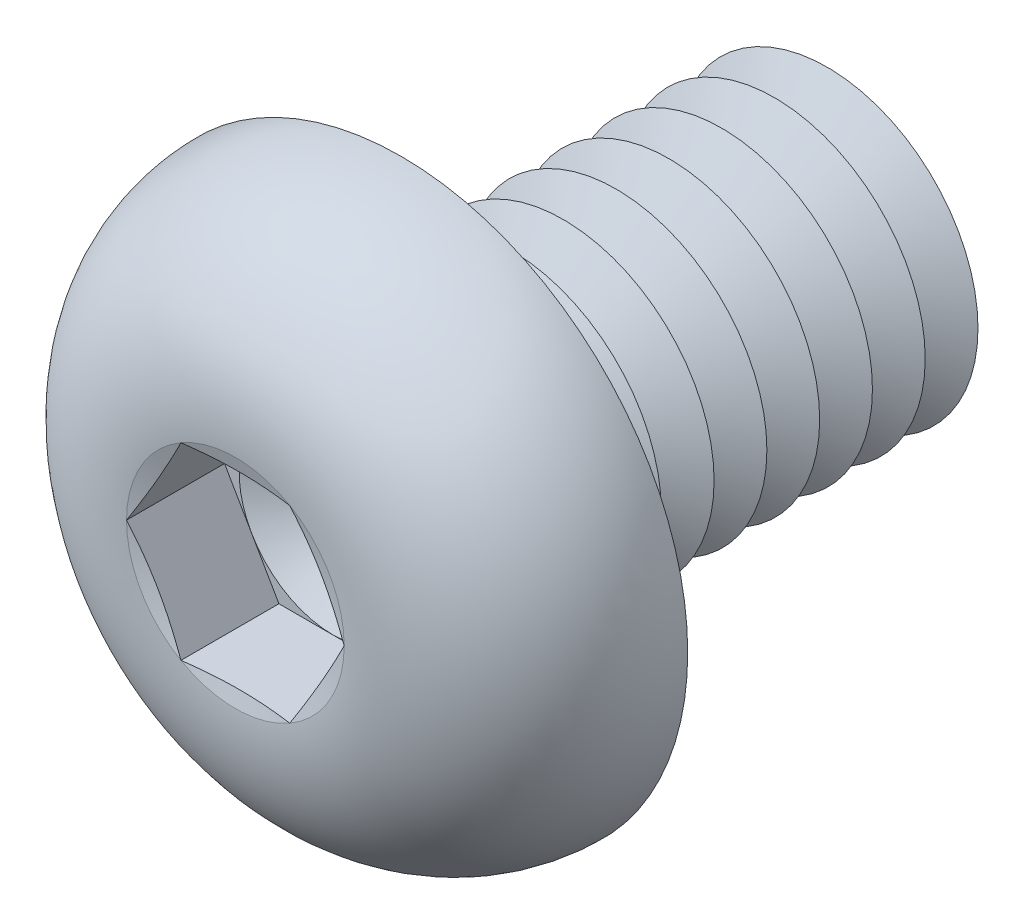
ISO-10303-21;
HEADER;
FILE_DESCRIPTION(('STEP AP214'),'2;1');
FILE_NAME('part.step','',(''),(''),'','','');
FILE_SCHEMA(('AUTOMOTIVE_DESIGN { 1 0 10303 214 1 1 1 1 }'));
ENDSEC;
DATA;
#1=APPLICATION_CONTEXT('core data for automotive mechanical design processes');
#2=APPLICATION_PROTOCOL_DEFINITION('international standard','automotive_design',2000,#1);
#3=PRODUCT_CONTEXT('',#1,'mechanical');
#4=PRODUCT('Part','Part','',(#3));
#5=PRODUCT_RELATED_PRODUCT_CATEGORY('part','',(#4));
#6=PRODUCT_DEFINITION_FORMATION('','',#4);
#7=PRODUCT_DEFINITION_CONTEXT('part definition',#1,'design');
#8=PRODUCT_DEFINITION('design','',#6,#7);
#9=PRODUCT_DEFINITION_SHAPE('','',#8);
#10=(LENGTH_UNIT() NAMED_UNIT(*) SI_UNIT(.MILLI.,.METRE.));
#11=(NAMED_UNIT(*) PLANE_ANGLE_UNIT() SI_UNIT($,.RADIAN.));
#12=(NAMED_UNIT(*) SI_UNIT($,.STERADIAN.) SOLID_ANGLE_UNIT());
#13=UNCERTAINTY_MEASURE_WITH_UNIT(LENGTH_MEASURE(1.E-05),#10,'distance_accuracy_value','');
#14=(GEOMETRIC_REPRESENTATION_CONTEXT(3) GLOBAL_UNCERTAINTY_ASSIGNED_CONTEXT((#13)) GLOBAL_UNIT_ASSIGNED_CONTEXT((#10,
#11,#12)) REPRESENTATION_CONTEXT('',''));
#15=CARTESIAN_POINT('',(0.,0.,0.));
#16=DIRECTION('',(0.,0.,1.));
#17=DIRECTION('',(1.,0.,0.));
#18=AXIS2_PLACEMENT_3D('',#15,#16,#17);
#19=CARTESIAN_POINT('',(0.,0.,0.9));
#20=DIRECTION('',(0.,0.,1.));
#21=DIRECTION('',(1.,0.,0.));
#22=AXIS2_PLACEMENT_3D('',#19,#20,#21);
#23=PLANE('',#22);
#24=CARTESIAN_POINT('',(0.,0.,0.9));
#25=DIRECTION('',(0.,0.,1.));
#26=DIRECTION('',(1.,0.,0.));
#27=AXIS2_PLACEMENT_3D('',#24,#25,#26);
#28=CIRCLE('',#27,1.24999941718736);
#29=CARTESIAN_POINT('',(1.08253125,0.624999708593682,0.9));
#30=VERTEX_POINT('',#29);
#31=CARTESIAN_POINT('',(0.,1.24999941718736,0.9));
#32=VERTEX_POINT('',#31);
#33=EDGE_CURVE('E118',#30,#32,#28,.T.);
#34=ORIENTED_EDGE('',*,*,#33,.F.);
#35=DIRECTION('',(-0.5,0.866025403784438,0.));
#36=VECTOR('',#35,1.);
#37=CARTESIAN_POINT('',(1.443375,0.,0.9));
#38=LINE('',#37,#36);
#39=CARTESIAN_POINT('',(0.7216875,1.24999941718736,0.9));
#40=VERTEX_POINT('',#39);
#41=EDGE_CURVE('E125',#30,#40,#38,.T.);
#42=ORIENTED_EDGE('',*,*,#41,.T.);
#43=DIRECTION('',(-1.,0.,0.));
#44=VECTOR('',#43,1.);
#45=CARTESIAN_POINT('',(0.7216875,1.24999941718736,0.9));
#46=LINE('',#45,#44);
#47=EDGE_CURVE('E136',#40,#32,#46,.T.);
#48=ORIENTED_EDGE('',*,*,#47,.T.);
#49=EDGE_LOOP('',(#34,#42,#48));
#50=FACE_BOUND('',#49,.T.);
#51=ADVANCED_FACE('F39',(#50),#23,.T.);
#52=CARTESIAN_POINT('',(0.,0.,0.9));
#53=DIRECTION('',(0.,0.,1.));
#54=DIRECTION('',(1.,0.,0.));
#55=AXIS2_PLACEMENT_3D('',#52,#53,#54);
#56=CIRCLE('',#55,1.24999941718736);
#57=CARTESIAN_POINT('',(-1.08253125,0.624999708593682,0.9));
#58=VERTEX_POINT('',#57);
#59=EDGE_CURVE('E11',#32,#58,#56,.T.);
#60=ORIENTED_EDGE('',*,*,#59,.F.);
#61=CARTESIAN_POINT('',(-0.721687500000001,1.24999941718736,0.9));
#62=VERTEX_POINT('',#61);
#63=EDGE_CURVE('E131',#32,#62,#46,.T.);
#64=ORIENTED_EDGE('',*,*,#63,.T.);
#65=DIRECTION('',(-0.5,-0.866025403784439,0.));
#66=VECTOR('',#65,1.);
#67=CARTESIAN_POINT('',(-0.721687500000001,1.24999941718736,0.9));
#68=LINE('',#67,#66);
#69=EDGE_CURVE('E134',#62,#58,#68,.T.);
#70=ORIENTED_EDGE('',*,*,#69,.T.);
#71=EDGE_LOOP('',(#60,#64,#70));
#72=FACE_BOUND('',#71,.T.);
#73=ADVANCED_FACE('F130',(#72),#23,.T.);
#74=CARTESIAN_POINT('',(-1.08253125,-0.624999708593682,0.9));
#75=VERTEX_POINT('',#74);
#76=EDGE_CURVE('E49',#58,#75,#56,.T.);
#77=ORIENTED_EDGE('',*,*,#76,.F.);
#78=CARTESIAN_POINT('',(-1.443375,0.,0.9));
#79=VERTEX_POINT('',#78);
#80=EDGE_CURVE('E143',#58,#79,#68,.T.);
#81=ORIENTED_EDGE('',*,*,#80,.T.);
#82=DIRECTION('',(0.5,-0.866025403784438,0.));
#83=VECTOR('',#82,1.);
#84=CARTESIAN_POINT('',(-1.443375,0.,0.9));
#85=LINE('',#84,#83);
#86=EDGE_CURVE('E152',#79,#75,#85,.T.);
#87=ORIENTED_EDGE('',*,*,#86,.T.);
#88=EDGE_LOOP('',(#77,#81,#87));
#89=FACE_BOUND('',#88,.T.);
#90=ADVANCED_FACE('F336',(#89),#23,.T.);
#91=CARTESIAN_POINT('',(0.,-1.24999941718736,0.9));
#92=VERTEX_POINT('',#91);
#93=EDGE_CURVE('E320',#75,#92,#56,.T.);
#94=ORIENTED_EDGE('',*,*,#93,.F.);
#95=CARTESIAN_POINT('',(-0.721687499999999,-1.24999941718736,0.9));
#96=VERTEX_POINT('',#95);
#97=EDGE_CURVE('E151',#75,#96,#85,.T.);
#98=ORIENTED_EDGE('',*,*,#97,.T.);
#99=DIRECTION('',(1.,0.,0.));
#100=VECTOR('',#99,1.);
#101=CARTESIAN_POINT('',(-0.721687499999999,-1.24999941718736,0.9));
#102=LINE('',#101,#100);
#103=EDGE_CURVE('E157',#96,#92,#102,.T.);
#104=ORIENTED_EDGE('',*,*,#103,.T.);
#105=EDGE_LOOP('',(#94,#98,#104));
#106=FACE_BOUND('',#105,.T.);
#107=ADVANCED_FACE('F330',(#106),#23,.T.);
#108=CARTESIAN_POINT('',(1.08253125,-0.624999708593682,0.9));
#109=VERTEX_POINT('',#108);
#110=EDGE_CURVE('E56',#92,#109,#56,.T.);
#111=ORIENTED_EDGE('',*,*,#110,.F.);
#112=CARTESIAN_POINT('',(0.721687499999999,-1.24999941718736,0.9));
#113=VERTEX_POINT('',#112);
#114=EDGE_CURVE('E156',#92,#113,#102,.T.);
#115=ORIENTED_EDGE('',*,*,#114,.T.);
#116=DIRECTION('',(0.5,0.866025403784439,0.));
#117=VECTOR('',#116,1.);
#118=CARTESIAN_POINT('',(0.721687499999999,-1.24999941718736,0.9));
#119=LINE('',#118,#117);
#120=EDGE_CURVE('E162',#113,#109,#119,.T.);
#121=ORIENTED_EDGE('',*,*,#120,.T.);
#122=EDGE_LOOP('',(#111,#115,#121));
#123=FACE_BOUND('',#122,.T.);
#124=ADVANCED_FACE('F419',(#123),#23,.T.);
#125=CARTESIAN_POINT('',(0.,0.,2.2));
#126=DIRECTION('',(0.,0.,1.));
#127=DIRECTION('',(1.,0.,0.));
#128=AXIS2_PLACEMENT_3D('',#125,#126,#127);
#129=CONICAL_SURFACE('',#128,1.443375,1.30899693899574);
#130=CARTESIAN_POINT('',(1.44349047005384,-0.000199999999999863,2.2000309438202));
#131=CARTESIAN_POINT('',(1.41351104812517,0.0517258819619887,2.19199301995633));
#132=CARTESIAN_POINT('',(1.38347725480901,0.10374593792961,2.18469579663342));
#133=CARTESIAN_POINT('',(1.32330355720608,0.207969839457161,2.17187512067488));
#134=CARTESIAN_POINT('',(1.29316361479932,0.260173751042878,2.16635238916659));
#135=CARTESIAN_POINT('',(1.23296043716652,0.364448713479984,2.15740323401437));
#136=CARTESIAN_POINT('',(1.20289760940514,0.416519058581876,2.15396613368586));
#137=CARTESIAN_POINT('',(1.14273359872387,0.520726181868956,2.14935732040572));
#138=CARTESIAN_POINT('',(1.11263242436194,0.572862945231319,2.14818516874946));
#139=CARTESIAN_POINT('',(1.05243007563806,0.677136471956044,2.14818516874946));
#140=CARTESIAN_POINT('',(1.02232890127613,0.729273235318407,2.14935732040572));
#141=CARTESIAN_POINT('',(0.962164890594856,0.833480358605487,2.15396613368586));
#142=CARTESIAN_POINT('',(0.932102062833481,0.885550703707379,2.15740323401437));
#143=CARTESIAN_POINT('',(0.87189888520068,0.989825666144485,2.16635238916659));
#144=CARTESIAN_POINT('',(0.841758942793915,1.0420295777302,2.17187512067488));
#145=CARTESIAN_POINT('',(0.781585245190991,1.14625347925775,2.18469579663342));
#146=CARTESIAN_POINT('',(0.751551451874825,1.19827353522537,2.19199301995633));
#147=CARTESIAN_POINT('',(0.721572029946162,1.25019941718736,2.20003094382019));
#148=B_SPLINE_CURVE_WITH_KNOTS('',3,(#130,#131,#132,#133,#134,#135,#136,#137,#138,#139,#140,
#141,#142,#143,#144,#145,#146,#147),.UNSPECIFIED.,.F.,.F.,(4,2,2,2,2,2,2,2,4),(0.,
0.181495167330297,0.363063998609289,0.543695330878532,0.724291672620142,0.904888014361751,
1.08551934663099,1.26708817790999,1.44858334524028),.UNSPECIFIED.);
#149=CARTESIAN_POINT('',(1.443375,0.,2.2));
#150=VERTEX_POINT('',#149);
#151=CARTESIAN_POINT('',(0.721687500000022,1.24999941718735,2.2));
#152=VERTEX_POINT('',#151);
#153=EDGE_CURVE('E222',#150,#152,#148,.T.);
#154=ORIENTED_EDGE('',*,*,#153,.F.);
#155=CARTESIAN_POINT('',(0.,0.,2.2));
#156=DIRECTION('',(0.,0.,-1.));
#157=DIRECTION('',(-1.,0.,0.));
#158=AXIS2_PLACEMENT_3D('',#155,#156,#157);
#159=CIRCLE('',#158,1.443375);
#160=EDGE_CURVE('E367',#152,#150,#159,.T.);
#161=ORIENTED_EDGE('',*,*,#160,.F.);
#162=EDGE_LOOP('',(#154,#161));
#163=FACE_BOUND('',#162,.T.);
#164=ADVANCED_FACE('F386',(#163),#129,.F.);
#165=CARTESIAN_POINT('',(0.721572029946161,-1.25019941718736,2.2000309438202));
#166=CARTESIAN_POINT('',(0.751551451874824,-1.19827353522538,2.19199301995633));
#167=CARTESIAN_POINT('',(0.78158524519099,-1.14625347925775,2.18469579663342));
#168=CARTESIAN_POINT('',(0.841758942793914,-1.0420295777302,2.17187512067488));
#169=CARTESIAN_POINT('',(0.87189888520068,-0.989825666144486,2.16635238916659));
#170=CARTESIAN_POINT('',(0.932102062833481,-0.88555070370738,2.15740323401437));
#171=CARTESIAN_POINT('',(0.962164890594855,-0.833480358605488,2.15396613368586));
#172=CARTESIAN_POINT('',(1.02232890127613,-0.729273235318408,2.14935732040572));
#173=CARTESIAN_POINT('',(1.05243007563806,-0.677136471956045,2.14818516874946));
#174=CARTESIAN_POINT('',(1.11263242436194,-0.572862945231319,2.14818516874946));
#175=CARTESIAN_POINT('',(1.14273359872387,-0.520726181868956,2.14935732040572));
#176=CARTESIAN_POINT('',(1.20289760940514,-0.416519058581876,2.15396613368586));
#177=CARTESIAN_POINT('',(1.23296043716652,-0.364448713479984,2.15740323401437));
#178=CARTESIAN_POINT('',(1.29316361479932,-0.260173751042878,2.16635238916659));
#179=CARTESIAN_POINT('',(1.32330355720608,-0.207969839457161,2.17187512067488));
#180=CARTESIAN_POINT('',(1.38347725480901,-0.10374593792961,2.18469579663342));
#181=CARTESIAN_POINT('',(1.41351104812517,-0.0517258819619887,2.19199301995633));
#182=CARTESIAN_POINT('',(1.44349047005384,0.000199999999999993,2.20003094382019));
#183=B_SPLINE_CURVE_WITH_KNOTS('',3,(#165,#166,#167,#168,#169,#170,#171,#172,#173,#174,#175,
#176,#177,#178,#179,#180,#181,#182),.UNSPECIFIED.,.F.,.F.,(4,2,2,2,2,2,2,2,4),(0.,
0.181495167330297,0.36306399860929,0.543695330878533,0.724291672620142,0.904888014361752,
1.085519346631,1.26708817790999,1.44858334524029),.UNSPECIFIED.);
#184=CARTESIAN_POINT('',(0.721687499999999,-1.24999941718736,2.2));
#185=VERTEX_POINT('',#184);
#186=EDGE_CURVE('E231',#185,#150,#183,.T.);
#187=ORIENTED_EDGE('',*,*,#186,.F.);
#188=EDGE_CURVE('E369',#150,#185,#159,.T.);
#189=ORIENTED_EDGE('',*,*,#188,.F.);
#190=EDGE_LOOP('',(#187,#189));
#191=FACE_BOUND('',#190,.T.);
#192=ADVANCED_FACE('F388',(#191),#129,.F.);
#193=CARTESIAN_POINT('',(-2.17815859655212,-1.24999941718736,2.48616275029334));
#194=CARTESIAN_POINT('',(-2.07269794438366,-1.24999941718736,2.4616881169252));
#195=CARTESIAN_POINT('',(-1.96714913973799,-1.24999941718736,2.43756889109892));
#196=CARTESIAN_POINT('',(-1.75576352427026,-1.24999941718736,2.39052699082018));
#197=CARTESIAN_POINT('',(-1.64992665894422,-1.24999941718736,2.36760456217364));
#198=CARTESIAN_POINT('',(-1.43690237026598,-1.24999941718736,2.3232454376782));
#199=CARTESIAN_POINT('',(-1.32971158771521,-1.24999941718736,2.30182468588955));
#200=CARTESIAN_POINT('',(-1.1148274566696,-1.24999941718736,2.26156703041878));
#201=CARTESIAN_POINT('',(-1.00713406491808,-1.24999941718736,2.24273035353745));
#202=CARTESIAN_POINT('',(-0.794044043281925,-1.24999941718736,2.2093913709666));
#203=CARTESIAN_POINT('',(-0.688664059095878,-1.24999941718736,2.19478562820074));
#204=CARTESIAN_POINT('',(-0.477310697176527,-1.24999941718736,2.17085809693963));
#205=CARTESIAN_POINT('',(-0.371337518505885,-1.24999941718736,2.16153463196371));
#206=CARTESIAN_POINT('',(-0.159455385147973,-1.24999941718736,2.14976770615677));
#207=CARTESIAN_POINT('',(-0.0535482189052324,-1.24999941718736,2.14729400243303));
#208=CARTESIAN_POINT('',(0.158189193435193,-1.24999941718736,2.14966287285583));
#209=CARTESIAN_POINT('',(0.264019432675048,-1.24999941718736,2.15450603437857));
#210=CARTESIAN_POINT('',(0.445148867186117,-1.24999941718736,2.16825380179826));
#211=CARTESIAN_POINT('',(0.520574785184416,-1.24999941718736,2.17561242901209));
#212=CARTESIAN_POINT('',(0.671115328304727,-1.24999941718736,2.19297000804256));
#213=CARTESIAN_POINT('',(0.746229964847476,-1.24999941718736,2.20296886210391));
#214=CARTESIAN_POINT('',(0.896387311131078,-1.24999941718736,2.22505910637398));
#215=CARTESIAN_POINT('',(0.971429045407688,-1.24999941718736,2.23715700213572));
#216=CARTESIAN_POINT('',(1.12124320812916,-1.24999941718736,2.26292371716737));
#217=CARTESIAN_POINT('',(1.19601562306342,-1.24999941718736,2.27659261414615));
#218=CARTESIAN_POINT('',(1.34686913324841,-1.24999941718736,2.30540811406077));
#219=CARTESIAN_POINT('',(1.42294548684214,-1.24999941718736,2.32057934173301));
#220=CARTESIAN_POINT('',(1.57490676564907,-1.24999941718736,2.35185113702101));
#221=CARTESIAN_POINT('',(1.65079168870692,-1.24999941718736,2.36795171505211));
#222=CARTESIAN_POINT('',(1.80199501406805,-1.24999941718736,2.40076814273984));
#223=CARTESIAN_POINT('',(1.87731425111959,-1.24999941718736,2.41748016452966));
#224=CARTESIAN_POINT('',(2.02782424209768,-1.24999941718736,2.45144971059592));
#225=CARTESIAN_POINT('',(2.10301500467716,-1.24999941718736,2.46870719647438));
#226=CARTESIAN_POINT('',(2.17815859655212,-1.24999941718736,2.48616275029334));
#227=B_SPLINE_CURVE_WITH_KNOTS('',3,(#193,#194,#195,#196,#197,#198,#199,#200,#201,#202,#203,
#204,#205,#206,#207,#208,#209,#210,#211,#212,#213,#214,#215,#216,#217,#218,#219,#220,#221,#222,
#223,#224,#225,#226),.UNSPECIFIED.,.F.,.F.,(4,2,2,2,2,2,2,2,2,2,2,2,2,2,2,2,4),(0.,
0.324797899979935,0.649662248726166,0.977572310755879,1.30551113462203,1.62458166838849,
1.94355087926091,2.26110952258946,2.57869365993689,2.80599541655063,3.03328875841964,
3.2612995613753,3.48932164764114,3.7220371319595,3.95475522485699,4.18620606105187,
4.41764064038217),.UNSPECIFIED.);
#228=CARTESIAN_POINT('',(-0.721687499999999,-1.24999941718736,2.2));
#229=VERTEX_POINT('',#228);
#230=EDGE_CURVE('E348',#229,#185,#227,.T.);
#231=ORIENTED_EDGE('',*,*,#230,.F.);
#232=EDGE_CURVE('E356',#185,#229,#159,.T.);
#233=ORIENTED_EDGE('',*,*,#232,.F.);
#234=EDGE_LOOP('',(#231,#233));
#235=FACE_BOUND('',#234,.T.);
#236=ADVANCED_FACE('F391',(#235),#129,.F.);
#237=CARTESIAN_POINT('',(-1.44349047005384,0.000200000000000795,2.2000309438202));
#238=CARTESIAN_POINT('',(-1.41351104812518,-0.0517258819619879,2.19199301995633));
#239=CARTESIAN_POINT('',(-1.38347725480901,-0.10374593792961,2.18469579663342));
#240=CARTESIAN_POINT('',(-1.32330355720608,-0.20796983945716,2.17187512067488));
#241=CARTESIAN_POINT('',(-1.29316361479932,-0.260173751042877,2.16635238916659));
#242=CARTESIAN_POINT('',(-1.23296043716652,-0.364448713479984,2.15740323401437));
#243=CARTESIAN_POINT('',(-1.20289760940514,-0.416519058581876,2.15396613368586));
#244=CARTESIAN_POINT('',(-1.14273359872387,-0.520726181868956,2.14935732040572));
#245=CARTESIAN_POINT('',(-1.11263242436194,-0.572862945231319,2.14818516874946));
#246=CARTESIAN_POINT('',(-1.05243007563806,-0.677136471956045,2.14818516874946));
#247=CARTESIAN_POINT('',(-1.02232890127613,-0.729273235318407,2.14935732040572));
#248=CARTESIAN_POINT('',(-0.962164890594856,-0.833480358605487,2.15396613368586));
#249=CARTESIAN_POINT('',(-0.932102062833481,-0.885550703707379,2.15740323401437));
#250=CARTESIAN_POINT('',(-0.87189888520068,-0.989825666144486,2.16635238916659));
#251=CARTESIAN_POINT('',(-0.841758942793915,-1.0420295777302,2.17187512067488));
#252=CARTESIAN_POINT('',(-0.78158524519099,-1.14625347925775,2.18469579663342));
#253=CARTESIAN_POINT('',(-0.751551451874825,-1.19827353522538,2.19199301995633));
#254=CARTESIAN_POINT('',(-0.721572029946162,-1.25019941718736,2.2000309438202));
#255=B_SPLINE_CURVE_WITH_KNOTS('',3,(#237,#238,#239,#240,#241,#242,#243,#244,#245,#246,#247,
#248,#249,#250,#251,#252,#253,#254),.UNSPECIFIED.,.F.,.F.,(4,2,2,2,2,2,2,2,4),(0.,
0.181495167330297,0.36306399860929,0.543695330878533,0.724291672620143,0.904888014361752,
1.085519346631,1.26708817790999,1.44858334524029),.UNSPECIFIED.);
#256=CARTESIAN_POINT('',(-1.443375,0.,2.2));
#257=VERTEX_POINT('',#256);
#258=EDGE_CURVE('E341',#257,#229,#255,.T.);
#259=ORIENTED_EDGE('',*,*,#258,.F.);
#260=EDGE_CURVE('E300',#229,#257,#159,.T.);
#261=ORIENTED_EDGE('',*,*,#260,.F.);
#262=EDGE_LOOP('',(#259,#261));
#263=FACE_BOUND('',#262,.T.);
#264=ADVANCED_FACE('F345',(#263),#129,.F.);
#265=CARTESIAN_POINT('',(-0.721572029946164,1.25019941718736,2.2000309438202));
#266=CARTESIAN_POINT('',(-0.751551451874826,1.19827353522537,2.19199301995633));
#267=CARTESIAN_POINT('',(-0.781585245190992,1.14625347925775,2.18469579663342));
#268=CARTESIAN_POINT('',(-0.841758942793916,1.0420295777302,2.17187512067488));
#269=CARTESIAN_POINT('',(-0.871898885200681,0.989825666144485,2.16635238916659));
#270=CARTESIAN_POINT('',(-0.932102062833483,0.885550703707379,2.15740323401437));
#271=CARTESIAN_POINT('',(-0.962164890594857,0.833480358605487,2.15396613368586));
#272=CARTESIAN_POINT('',(-1.02232890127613,0.729273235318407,2.14935732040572));
#273=CARTESIAN_POINT('',(-1.05243007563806,0.677136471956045,2.14818516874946));
#274=CARTESIAN_POINT('',(-1.11263242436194,0.572862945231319,2.14818516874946));
#275=CARTESIAN_POINT('',(-1.14273359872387,0.520726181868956,2.14935732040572));
#276=CARTESIAN_POINT('',(-1.20289760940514,0.416519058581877,2.15396613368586));
#277=CARTESIAN_POINT('',(-1.23296043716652,0.364448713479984,2.15740323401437));
#278=CARTESIAN_POINT('',(-1.29316361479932,0.260173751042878,2.16635238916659));
#279=CARTESIAN_POINT('',(-1.32330355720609,0.207969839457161,2.17187512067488));
#280=CARTESIAN_POINT('',(-1.38347725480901,0.103745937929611,2.18469579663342));
#281=CARTESIAN_POINT('',(-1.41351104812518,0.0517258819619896,2.19199301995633));
#282=CARTESIAN_POINT('',(-1.44349047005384,-0.00019999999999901,2.2000309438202));
#283=B_SPLINE_CURVE_WITH_KNOTS('',3,(#265,#266,#267,#268,#269,#270,#271,#272,#273,#274,#275,
#276,#277,#278,#279,#280,#281,#282),.UNSPECIFIED.,.F.,.F.,(4,2,2,2,2,2,2,2,4),(0.,
0.181495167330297,0.363063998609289,0.543695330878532,0.724291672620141,0.90488801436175,
1.08551934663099,1.26708817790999,1.44858334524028),.UNSPECIFIED.);
#284=CARTESIAN_POINT('',(-0.721687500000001,1.24999941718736,2.2));
#285=VERTEX_POINT('',#284);
#286=EDGE_CURVE('E195',#285,#257,#283,.T.);
#287=ORIENTED_EDGE('',*,*,#286,.F.);
#288=EDGE_CURVE('E301',#257,#285,#159,.T.);
#289=ORIENTED_EDGE('',*,*,#288,.F.);
#290=EDGE_LOOP('',(#287,#289));
#291=FACE_BOUND('',#290,.T.);
#292=ADVANCED_FACE('F359',(#291),#129,.F.);
#293=CARTESIAN_POINT('',(0.,0.,-3.55));
#294=DIRECTION('',(0.,0.,1.));
#295=DIRECTION('',(1.,0.,0.));
#296=AXIS2_PLACEMENT_3D('',#293,#294,#295);
#297=CONICAL_SURFACE('',#296,2.,1.0471975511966);
#298=CARTESIAN_POINT('',(0.,0.,-3.9));
#299=DIRECTION('',(0.,0.,1.));
#300=DIRECTION('',(1.,0.,0.));
#301=AXIS2_PLACEMENT_3D('',#298,#299,#300);
#302=CIRCLE('',#301,1.3937822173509);
#303=CARTESIAN_POINT('',(1.3937822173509,0.,-3.9));
#304=VERTEX_POINT('',#303);
#305=EDGE_CURVE('E272',#304,#304,#302,.T.);
#306=ORIENTED_EDGE('',*,*,#305,.T.);
#307=EDGE_LOOP('',(#306));
#308=FACE_BOUND('',#307,.T.);
#309=CARTESIAN_POINT('',(0.,0.,-3.55));
#310=DIRECTION('',(0.,0.,1.));
#311=DIRECTION('',(1.,0.,0.));
#312=AXIS2_PLACEMENT_3D('',#309,#310,#311);
#313=CIRCLE('',#312,2.);
#314=CARTESIAN_POINT('',(2.,0.,-3.55));
#315=VERTEX_POINT('',#314);
#316=EDGE_CURVE('E268',#315,#315,#313,.T.);
#317=ORIENTED_EDGE('',*,*,#316,.F.);
#318=EDGE_LOOP('',(#317));
#319=FACE_BOUND('',#318,.T.);
#320=ADVANCED_FACE('F471',(#308,#319),#297,.T.);
#321=CARTESIAN_POINT('',(0.,0.,-3.9));
#322=DIRECTION('',(0.,0.,-1.));
#323=DIRECTION('',(-1.,0.,0.));
#324=AXIS2_PLACEMENT_3D('',#321,#322,#323);
#325=CONICAL_SURFACE('',#324,1.3937822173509,1.0471975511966);
#326=CARTESIAN_POINT('',(0.,0.,-4.25));
#327=DIRECTION('',(0.,0.,1.));
#328=DIRECTION('',(1.,0.,0.));
#329=AXIS2_PLACEMENT_3D('',#326,#327,#328);
#330=CIRCLE('',#329,2.);
#331=CARTESIAN_POINT('',(2.,0.,-4.25));
#332=VERTEX_POINT('',#331);
#333=EDGE_CURVE('E276',#332,#332,#330,.T.);
#334=ORIENTED_EDGE('',*,*,#333,.T.);
#335=EDGE_LOOP('',(#334));
#336=FACE_BOUND('',#335,.T.);
#337=ORIENTED_EDGE('',*,*,#305,.F.);
#338=EDGE_LOOP('',(#337));
#339=FACE_BOUND('',#338,.T.);
#340=ADVANCED_FACE('F634',(#336,#339),#325,.T.);
#341=CARTESIAN_POINT('',(0.,2.,-6.));
#342=DIRECTION('',(0.,0.,-1.));
#343=DIRECTION('',(-1.,0.,0.));
#344=AXIS2_PLACEMENT_3D('',#341,#342,#343);
#345=PLANE('',#344);
#346=CARTESIAN_POINT('',(0.,0.,-6.));
#347=DIRECTION('',(0.,0.,1.));
#348=DIRECTION('',(1.,0.,0.));
#349=AXIS2_PLACEMENT_3D('',#346,#347,#348);
#350=CIRCLE('',#349,1.3937822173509);
#351=CARTESIAN_POINT('',(1.3937822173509,0.,-6.));
#352=VERTEX_POINT('',#351);
#353=EDGE_CURVE('E296',#352,#352,#350,.T.);
#354=ORIENTED_EDGE('',*,*,#353,.F.);
#355=EDGE_LOOP('',(#354));
#356=FACE_BOUND('',#355,.T.);
#357=ADVANCED_FACE('F639',(#356),#345,.T.);
#358=CARTESIAN_POINT('',(0.,0.,-5.65));
#359=DIRECTION('',(0.,0.,1.));
#360=DIRECTION('',(1.,0.,0.));
#361=AXIS2_PLACEMENT_3D('',#358,#359,#360);
#362=CONICAL_SURFACE('',#361,2.,1.0471975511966);
#363=ORIENTED_EDGE('',*,*,#353,.T.);
#364=EDGE_LOOP('',(#363));
#365=FACE_BOUND('',#364,.T.);
#366=CARTESIAN_POINT('',(0.,0.,-5.65));
#367=DIRECTION('',(0.,0.,1.));
#368=DIRECTION('',(1.,0.,0.));
#369=AXIS2_PLACEMENT_3D('',#366,#367,#368);
#370=CIRCLE('',#369,2.);
#371=CARTESIAN_POINT('',(2.,0.,-5.65));
#372=VERTEX_POINT('',#371);
#373=EDGE_CURVE('E292',#372,#372,#370,.T.);
#374=ORIENTED_EDGE('',*,*,#373,.F.);
#375=EDGE_LOOP('',(#374));
#376=FACE_BOUND('',#375,.T.);
#377=ADVANCED_FACE('F627',(#365,#376),#362,.T.);
#378=CARTESIAN_POINT('',(0.,0.,-5.3));
#379=DIRECTION('',(0.,0.,-1.));
#380=DIRECTION('',(-1.,0.,0.));
#381=AXIS2_PLACEMENT_3D('',#378,#379,#380);
#382=CONICAL_SURFACE('',#381,1.3937822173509,1.0471975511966);
#383=ORIENTED_EDGE('',*,*,#373,.T.);
#384=EDGE_LOOP('',(#383));
#385=FACE_BOUND('',#384,.T.);
#386=CARTESIAN_POINT('',(0.,0.,-5.3));
#387=DIRECTION('',(0.,0.,1.));
#388=DIRECTION('',(1.,0.,0.));
#389=AXIS2_PLACEMENT_3D('',#386,#387,#388);
#390=CIRCLE('',#389,1.3937822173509);
#391=CARTESIAN_POINT('',(1.3937822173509,0.,-5.3));
#392=VERTEX_POINT('',#391);
#393=EDGE_CURVE('E288',#392,#392,#390,.T.);
#394=ORIENTED_EDGE('',*,*,#393,.F.);
#395=EDGE_LOOP('',(#394));
#396=FACE_BOUND('',#395,.T.);
#397=ADVANCED_FACE('F617',(#385,#396),#382,.T.);
#398=CARTESIAN_POINT('',(0.,0.,-4.95));
#399=DIRECTION('',(0.,0.,1.));
#400=DIRECTION('',(1.,0.,0.));
#401=AXIS2_PLACEMENT_3D('',#398,#399,#400);
#402=CONICAL_SURFACE('',#401,2.,1.0471975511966);
#403=ORIENTED_EDGE('',*,*,#393,.T.);
#404=EDGE_LOOP('',(#403));
#405=FACE_BOUND('',#404,.T.);
#406=CARTESIAN_POINT('',(0.,0.,-4.95));
#407=DIRECTION('',(0.,0.,1.));
#408=DIRECTION('',(1.,0.,0.));
#409=AXIS2_PLACEMENT_3D('',#406,#407,#408);
#410=CIRCLE('',#409,2.);
#411=CARTESIAN_POINT('',(2.,0.,-4.95));
#412=VERTEX_POINT('',#411);
#413=EDGE_CURVE('E284',#412,#412,#410,.T.);
#414=ORIENTED_EDGE('',*,*,#413,.F.);
#415=EDGE_LOOP('',(#414));
#416=FACE_BOUND('',#415,.T.);
#417=ADVANCED_FACE('F607',(#405,#416),#402,.T.);
#418=CARTESIAN_POINT('',(0.,0.,-4.6));
#419=DIRECTION('',(0.,0.,-1.));
#420=DIRECTION('',(-1.,0.,0.));
#421=AXIS2_PLACEMENT_3D('',#418,#419,#420);
#422=CONICAL_SURFACE('',#421,1.3937822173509,1.0471975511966);
#423=ORIENTED_EDGE('',*,*,#413,.T.);
#424=EDGE_LOOP('',(#423));
#425=FACE_BOUND('',#424,.T.);
#426=CARTESIAN_POINT('',(0.,0.,-4.6));
#427=DIRECTION('',(0.,0.,1.));
#428=DIRECTION('',(1.,0.,0.));
#429=AXIS2_PLACEMENT_3D('',#426,#427,#428);
#430=CIRCLE('',#429,1.3937822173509);
#431=CARTESIAN_POINT('',(1.3937822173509,0.,-4.6));
#432=VERTEX_POINT('',#431);
#433=EDGE_CURVE('E280',#432,#432,#430,.T.);
#434=ORIENTED_EDGE('',*,*,#433,.F.);
#435=EDGE_LOOP('',(#434));
#436=FACE_BOUND('',#435,.T.);
#437=ADVANCED_FACE('F597',(#425,#436),#422,.T.);
#438=CARTESIAN_POINT('',(0.,0.,-4.25));
#439=DIRECTION('',(0.,0.,1.));
#440=DIRECTION('',(1.,0.,0.));
#441=AXIS2_PLACEMENT_3D('',#438,#439,#440);
#442=CONICAL_SURFACE('',#441,2.,1.0471975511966);
#443=ORIENTED_EDGE('',*,*,#433,.T.);
#444=EDGE_LOOP('',(#443));
#445=FACE_BOUND('',#444,.T.);
#446=ORIENTED_EDGE('',*,*,#333,.F.);
#447=EDGE_LOOP('',(#446));
#448=FACE_BOUND('',#447,.T.);
#449=ADVANCED_FACE('F587',(#445,#448),#442,.T.);
#450=CARTESIAN_POINT('',(0.,0.,-2.85));
#451=DIRECTION('',(0.,0.,1.));
#452=DIRECTION('',(1.,0.,0.));
#453=AXIS2_PLACEMENT_3D('',#450,#451,#452);
#454=CONICAL_SURFACE('',#453,2.,1.0471975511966);
#455=CARTESIAN_POINT('',(0.,0.,-3.2));
#456=DIRECTION('',(0.,0.,1.));
#457=DIRECTION('',(1.,0.,0.));
#458=AXIS2_PLACEMENT_3D('',#455,#456,#457);
#459=CIRCLE('',#458,1.3937822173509);
#460=CARTESIAN_POINT('',(1.3937822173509,0.,-3.2));
#461=VERTEX_POINT('',#460);
#462=EDGE_CURVE('E264',#461,#461,#459,.T.);
#463=ORIENTED_EDGE('',*,*,#462,.T.);
#464=EDGE_LOOP('',(#463));
#465=FACE_BOUND('',#464,.T.);
#466=CARTESIAN_POINT('',(0.,0.,-2.85));
#467=DIRECTION('',(0.,0.,1.));
#468=DIRECTION('',(1.,0.,0.));
#469=AXIS2_PLACEMENT_3D('',#466,#467,#468);
#470=CIRCLE('',#469,2.);
#471=CARTESIAN_POINT('',(2.,0.,-2.85));
#472=VERTEX_POINT('',#471);
#473=EDGE_CURVE('E260',#472,#472,#470,.T.);
#474=ORIENTED_EDGE('',*,*,#473,.F.);
#475=EDGE_LOOP('',(#474));
#476=FACE_BOUND('',#475,.T.);
#477=ADVANCED_FACE('F577',(#465,#476),#454,.T.);
#478=CARTESIAN_POINT('',(0.,0.,-3.2));
#479=DIRECTION('',(0.,0.,-1.));
#480=DIRECTION('',(-1.,0.,0.));
#481=AXIS2_PLACEMENT_3D('',#478,#479,#480);
#482=CONICAL_SURFACE('',#481,1.3937822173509,1.0471975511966);
#483=ORIENTED_EDGE('',*,*,#316,.T.);
#484=EDGE_LOOP('',(#483));
#485=FACE_BOUND('',#484,.T.);
#486=ORIENTED_EDGE('',*,*,#462,.F.);
#487=EDGE_LOOP('',(#486));
#488=FACE_BOUND('',#487,.T.);
#489=ADVANCED_FACE('F567',(#485,#488),#482,.T.);
#490=CARTESIAN_POINT('',(0.,0.,-2.15));
#491=DIRECTION('',(0.,0.,1.));
#492=DIRECTION('',(1.,0.,0.));
#493=AXIS2_PLACEMENT_3D('',#490,#491,#492);
#494=CONICAL_SURFACE('',#493,2.,1.0471975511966);
#495=CARTESIAN_POINT('',(0.,0.,-2.5));
#496=DIRECTION('',(0.,0.,1.));
#497=DIRECTION('',(1.,0.,0.));
#498=AXIS2_PLACEMENT_3D('',#495,#496,#497);
#499=CIRCLE('',#498,1.3937822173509);
#500=CARTESIAN_POINT('',(1.3937822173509,0.,-2.5));
#501=VERTEX_POINT('',#500);
#502=EDGE_CURVE('E256',#501,#501,#499,.T.);
#503=ORIENTED_EDGE('',*,*,#502,.T.);
#504=EDGE_LOOP('',(#503));
#505=FACE_BOUND('',#504,.T.);
#506=CARTESIAN_POINT('',(0.,0.,-2.15));
#507=DIRECTION('',(0.,0.,1.));
#508=DIRECTION('',(1.,0.,0.));
#509=AXIS2_PLACEMENT_3D('',#506,#507,#508);
#510=CIRCLE('',#509,2.);
#511=CARTESIAN_POINT('',(2.,0.,-2.15));
#512=VERTEX_POINT('',#511);
#513=EDGE_CURVE('E253',#512,#512,#510,.T.);
#514=ORIENTED_EDGE('',*,*,#513,.F.);
#515=EDGE_LOOP('',(#514));
#516=FACE_BOUND('',#515,.T.);
#517=ADVANCED_FACE('F557',(#505,#516),#494,.T.);
#518=CARTESIAN_POINT('',(0.,0.,-2.5));
#519=DIRECTION('',(0.,0.,-1.));
#520=DIRECTION('',(-1.,0.,0.));
#521=AXIS2_PLACEMENT_3D('',#518,#519,#520);
#522=CONICAL_SURFACE('',#521,1.3937822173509,1.0471975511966);
#523=ORIENTED_EDGE('',*,*,#473,.T.);
#524=EDGE_LOOP('',(#523));
#525=FACE_BOUND('',#524,.T.);
#526=ORIENTED_EDGE('',*,*,#502,.F.);
#527=EDGE_LOOP('',(#526));
#528=FACE_BOUND('',#527,.T.);
#529=ADVANCED_FACE('F547',(#525,#528),#522,.T.);
#530=CARTESIAN_POINT('',(0.,0.,-1.45));
#531=DIRECTION('',(0.,0.,1.));
#532=DIRECTION('',(1.,0.,0.));
#533=AXIS2_PLACEMENT_3D('',#530,#531,#532);
#534=CONICAL_SURFACE('',#533,2.,1.0471975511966);
#535=CARTESIAN_POINT('',(0.,0.,-1.8));
#536=DIRECTION('',(0.,0.,1.));
#537=DIRECTION('',(1.,0.,0.));
#538=AXIS2_PLACEMENT_3D('',#535,#536,#537);
#539=CIRCLE('',#538,1.3937822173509);
#540=CARTESIAN_POINT('',(1.3937822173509,0.,-1.8));
#541=VERTEX_POINT('',#540);
#542=EDGE_CURVE('E249',#541,#541,#539,.T.);
#543=ORIENTED_EDGE('',*,*,#542,.T.);
#544=EDGE_LOOP('',(#543));
#545=FACE_BOUND('',#544,.T.);
#546=CARTESIAN_POINT('',(0.,0.,-1.45));
#547=DIRECTION('',(0.,0.,1.));
#548=DIRECTION('',(1.,0.,0.));
#549=AXIS2_PLACEMENT_3D('',#546,#547,#548);
#550=CIRCLE('',#549,2.);
#551=CARTESIAN_POINT('',(2.,0.,-1.45));
#552=VERTEX_POINT('',#551);
#553=EDGE_CURVE('E241',#552,#552,#550,.T.);
#554=ORIENTED_EDGE('',*,*,#553,.F.);
#555=EDGE_LOOP('',(#554));
#556=FACE_BOUND('',#555,.T.);
#557=ADVANCED_FACE('F537',(#545,#556),#534,.T.);
#558=CARTESIAN_POINT('',(0.,0.,-1.8));
#559=DIRECTION('',(0.,0.,-1.));
#560=DIRECTION('',(-1.,0.,0.));
#561=AXIS2_PLACEMENT_3D('',#558,#559,#560);
#562=CONICAL_SURFACE('',#561,1.3937822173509,1.0471975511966);
#563=ORIENTED_EDGE('',*,*,#513,.T.);
#564=EDGE_LOOP('',(#563));
#565=FACE_BOUND('',#564,.T.);
#566=ORIENTED_EDGE('',*,*,#542,.F.);
#567=EDGE_LOOP('',(#566));
#568=FACE_BOUND('',#567,.T.);
#569=ADVANCED_FACE('F528',(#565,#568),#562,.T.);
#570=CARTESIAN_POINT('',(0.,0.,-0.750000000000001));
#571=DIRECTION('',(0.,0.,1.));
#572=DIRECTION('',(1.,0.,0.));
#573=AXIS2_PLACEMENT_3D('',#570,#571,#572);
#574=CONICAL_SURFACE('',#573,2.,1.0471975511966);
#575=CARTESIAN_POINT('',(0.,0.,-1.1));
#576=DIRECTION('',(0.,0.,1.));
#577=DIRECTION('',(1.,0.,0.));
#578=AXIS2_PLACEMENT_3D('',#575,#576,#577);
#579=CIRCLE('',#578,1.3937822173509);
#580=CARTESIAN_POINT('',(1.3937822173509,0.,-1.1));
#581=VERTEX_POINT('',#580);
#582=EDGE_CURVE('E230',#581,#581,#579,.T.);
#583=ORIENTED_EDGE('',*,*,#582,.T.);
#584=EDGE_LOOP('',(#583));
#585=FACE_BOUND('',#584,.T.);
#586=CARTESIAN_POINT('',(0.,0.,-0.750000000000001));
#587=DIRECTION('',(0.,0.,1.));
#588=DIRECTION('',(1.,0.,0.));
#589=AXIS2_PLACEMENT_3D('',#586,#587,#588);
#590=CIRCLE('',#589,2.);
#591=CARTESIAN_POINT('',(2.,0.,-0.750000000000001));
#592=VERTEX_POINT('',#591);
#593=EDGE_CURVE('E245',#592,#592,#590,.T.);
#594=ORIENTED_EDGE('',*,*,#593,.F.);
#595=EDGE_LOOP('',(#594));
#596=FACE_BOUND('',#595,.T.);
#597=ADVANCED_FACE('F519',(#585,#596),#574,.T.);
#598=CARTESIAN_POINT('',(0.,0.,-1.1));
#599=DIRECTION('',(0.,0.,-1.));
#600=DIRECTION('',(-1.,0.,0.));
#601=AXIS2_PLACEMENT_3D('',#598,#599,#600);
#602=CONICAL_SURFACE('',#601,1.3937822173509,1.0471975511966);
#603=ORIENTED_EDGE('',*,*,#553,.T.);
#604=EDGE_LOOP('',(#603));
#605=FACE_BOUND('',#604,.T.);
#606=ORIENTED_EDGE('',*,*,#582,.F.);
#607=EDGE_LOOP('',(#606));
#608=FACE_BOUND('',#607,.T.);
#609=ADVANCED_FACE('F219',(#605,#608),#602,.T.);
#610=CARTESIAN_POINT('',(2.17815859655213,1.24999941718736,2.48616275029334));
#611=CARTESIAN_POINT('',(2.07269794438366,1.24999941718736,2.4616881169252));
#612=CARTESIAN_POINT('',(1.96714913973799,1.24999941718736,2.43756889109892));
#613=CARTESIAN_POINT('',(1.75576352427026,1.24999941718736,2.39052699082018));
#614=CARTESIAN_POINT('',(1.64992665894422,1.24999941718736,2.36760456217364));
#615=CARTESIAN_POINT('',(1.43690237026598,1.24999941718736,2.3232454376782));
#616=CARTESIAN_POINT('',(1.32971158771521,1.24999941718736,2.30182468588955));
#617=CARTESIAN_POINT('',(1.1148274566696,1.24999941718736,2.26156703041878));
#618=CARTESIAN_POINT('',(1.00713406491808,1.24999941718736,2.24273035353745));
#619=CARTESIAN_POINT('',(0.794044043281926,1.24999941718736,2.2093913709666));
#620=CARTESIAN_POINT('',(0.688664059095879,1.24999941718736,2.19478562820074));
#621=CARTESIAN_POINT('',(0.477310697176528,1.24999941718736,2.17085809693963));
#622=CARTESIAN_POINT('',(0.371337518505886,1.24999941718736,2.16153463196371));
#623=CARTESIAN_POINT('',(0.159455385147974,1.24999941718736,2.14976770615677));
#624=CARTESIAN_POINT('',(0.0535482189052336,1.24999941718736,2.14729400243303));
#625=CARTESIAN_POINT('',(-0.158189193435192,1.24999941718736,2.14966287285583));
#626=CARTESIAN_POINT('',(-0.264019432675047,1.24999941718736,2.15450603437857));
#627=CARTESIAN_POINT('',(-0.445148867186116,1.24999941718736,2.16825380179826));
#628=CARTESIAN_POINT('',(-0.520574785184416,1.24999941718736,2.17561242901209));
#629=CARTESIAN_POINT('',(-0.671115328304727,1.24999941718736,2.19297000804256));
#630=CARTESIAN_POINT('',(-0.746229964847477,1.24999941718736,2.20296886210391));
#631=CARTESIAN_POINT('',(-0.896387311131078,1.24999941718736,2.22505910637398));
#632=CARTESIAN_POINT('',(-0.971429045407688,1.24999941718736,2.23715700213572));
#633=CARTESIAN_POINT('',(-1.12124320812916,1.24999941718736,2.26292371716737));
#634=CARTESIAN_POINT('',(-1.19601562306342,1.24999941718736,2.27659261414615));
#635=CARTESIAN_POINT('',(-1.34686913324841,1.24999941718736,2.30540811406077));
#636=CARTESIAN_POINT('',(-1.42294548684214,1.24999941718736,2.32057934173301));
#637=CARTESIAN_POINT('',(-1.57490676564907,1.24999941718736,2.35185113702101));
#638=CARTESIAN_POINT('',(-1.65079168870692,1.24999941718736,2.36795171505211));
#639=CARTESIAN_POINT('',(-1.80199501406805,1.24999941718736,2.40076814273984));
#640=CARTESIAN_POINT('',(-1.87731425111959,1.24999941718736,2.41748016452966));
#641=CARTESIAN_POINT('',(-2.02782424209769,1.24999941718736,2.45144971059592));
#642=CARTESIAN_POINT('',(-2.10301500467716,1.24999941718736,2.46870719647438));
#643=CARTESIAN_POINT('',(-2.17815859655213,1.24999941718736,2.48616275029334));
#644=B_SPLINE_CURVE_WITH_KNOTS('',3,(#610,#611,#612,#613,#614,#615,#616,#617,#618,#619,#620,
#621,#622,#623,#624,#625,#626,#627,#628,#629,#630,#631,#632,#633,#634,#635,#636,#637,#638,#639,
#640,#641,#642,#643),.UNSPECIFIED.,.F.,.F.,(4,2,2,2,2,2,2,2,2,2,2,2,2,2,2,2,4),(0.,
0.324797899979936,0.649662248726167,0.97757231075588,1.30551113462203,1.62458166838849,
1.94355087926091,2.26110952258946,2.5786936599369,2.80599541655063,3.03328875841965,
3.2612995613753,3.48932164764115,3.7220371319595,3.95475522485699,4.18620606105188,
4.41764064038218),.UNSPECIFIED.);
#645=EDGE_CURVE('E170',#152,#285,#644,.T.);
#646=ORIENTED_EDGE('',*,*,#645,.F.);
#647=EDGE_CURVE('E306',#285,#152,#159,.T.);
#648=ORIENTED_EDGE('',*,*,#647,.F.);
#649=EDGE_LOOP('',(#646,#648));
#650=FACE_BOUND('',#649,.T.);
#651=ADVANCED_FACE('F202',(#650),#129,.F.);
#652=CARTESIAN_POINT('',(0.,0.,0.));
#653=DIRECTION('',(0.,0.,-1.));
#654=DIRECTION('',(-1.,0.,0.));
#655=AXIS2_PLACEMENT_3D('',#652,#653,#654);
#656=DEGENERATE_TOROIDAL_SURFACE('',#655,1.59479522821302,2.20520477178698,.T.);
#657=ORIENTED_EDGE('',*,*,#288,.T.);
#658=ORIENTED_EDGE('',*,*,#647,.T.);
#659=ORIENTED_EDGE('',*,*,#160,.T.);
#660=ORIENTED_EDGE('',*,*,#188,.T.);
#661=ORIENTED_EDGE('',*,*,#232,.T.);
#662=ORIENTED_EDGE('',*,*,#260,.T.);
#663=EDGE_LOOP('',(#657,#658,#659,#660,#661,#662));
#664=FACE_BOUND('',#663,.T.);
#665=CARTESIAN_POINT('',(0.,0.,0.));
#666=DIRECTION('',(0.,0.,-1.));
#667=DIRECTION('',(-1.,0.,0.));
#668=AXIS2_PLACEMENT_3D('',#665,#666,#667);
#669=CIRCLE('',#668,3.8);
#670=CARTESIAN_POINT('',(-3.8,0.,0.));
#671=VERTEX_POINT('',#670);
#672=EDGE_CURVE('E305',#671,#671,#669,.T.);
#673=ORIENTED_EDGE('',*,*,#672,.F.);
#674=EDGE_LOOP('',(#673));
#675=FACE_BOUND('',#674,.T.);
#676=ADVANCED_FACE('F351',(#664,#675),#656,.T.);
#677=CARTESIAN_POINT('',(0.,2.,0.));
#678=DIRECTION('',(0.,0.,-1.));
#679=DIRECTION('',(-1.,0.,0.));
#680=AXIS2_PLACEMENT_3D('',#677,#678,#679);
#681=PLANE('',#680);
#682=CARTESIAN_POINT('',(0.,0.,0.));
#683=DIRECTION('',(0.,0.,-1.));
#684=DIRECTION('',(-1.,0.,0.));
#685=AXIS2_PLACEMENT_3D('',#682,#683,#684);
#686=CIRCLE('',#685,2.35);
#687=CARTESIAN_POINT('',(-2.35,0.,0.));
#688=VERTEX_POINT('',#687);
#689=EDGE_CURVE('E312',#688,#688,#686,.F.);
#690=ORIENTED_EDGE('',*,*,#689,.T.);
#691=EDGE_LOOP('',(#690));
#692=FACE_BOUND('',#691,.T.);
#693=ORIENTED_EDGE('',*,*,#672,.T.);
#694=EDGE_LOOP('',(#693));
#695=FACE_BOUND('',#694,.T.);
#696=ADVANCED_FACE('F452',(#692,#695),#681,.T.);
#697=CARTESIAN_POINT('',(0.,0.,-0.35));
#698=DIRECTION('',(0.,0.,-1.));
#699=DIRECTION('',(-1.,0.,0.));
#700=AXIS2_PLACEMENT_3D('',#697,#698,#699);
#701=TOROIDAL_SURFACE('',#700,2.35,0.35);
#702=ORIENTED_EDGE('',*,*,#689,.F.);
#703=EDGE_LOOP('',(#702));
#704=FACE_BOUND('',#703,.T.);
#705=CARTESIAN_POINT('',(0.,0.,-0.35));
#706=DIRECTION('',(0.,0.,-1.));
#707=DIRECTION('',(-1.,0.,0.));
#708=AXIS2_PLACEMENT_3D('',#705,#706,#707);
#709=CIRCLE('',#708,2.);
#710=CARTESIAN_POINT('',(-2.,0.,-0.35));
#711=VERTEX_POINT('',#710);
#712=EDGE_CURVE('E309',#711,#711,#709,.T.);
#713=ORIENTED_EDGE('',*,*,#712,.F.);
#714=EDGE_LOOP('',(#713));
#715=FACE_BOUND('',#714,.T.);
#716=ADVANCED_FACE('F41',(#704,#715),#701,.F.);
#717=CARTESIAN_POINT('',(0.,0.,-6.));
#718=DIRECTION('',(0.,0.,-1.));
#719=DIRECTION('',(-1.,0.,0.));
#720=AXIS2_PLACEMENT_3D('',#717,#718,#719);
#721=CYLINDRICAL_SURFACE('',#720,2.);
#722=ORIENTED_EDGE('',*,*,#712,.T.);
#723=EDGE_LOOP('',(#722));
#724=FACE_BOUND('',#723,.T.);
#725=ORIENTED_EDGE('',*,*,#593,.T.);
#726=EDGE_LOOP('',(#725));
#727=FACE_BOUND('',#726,.T.);
#728=ADVANCED_FACE('F217',(#724,#727),#721,.T.);
#729=CARTESIAN_POINT('',(1.443375,0.,0.9));
#730=DIRECTION('',(0.866025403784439,0.5,0.));
#731=DIRECTION('',(-0.5,0.866025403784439,0.));
#732=AXIS2_PLACEMENT_3D('',#729,#730,#731);
#733=PLANE('',#732);
#734=ORIENTED_EDGE('',*,*,#153,.T.);
#735=DIRECTION('',(0.,0.,1.));
#736=VECTOR('',#735,1.);
#737=CARTESIAN_POINT('',(0.7216875,1.24999941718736,0.9));
#738=LINE('',#737,#736);
#739=EDGE_CURVE('E64',#40,#152,#738,.T.);
#740=ORIENTED_EDGE('',*,*,#739,.F.);
#741=ORIENTED_EDGE('',*,*,#41,.F.);
#742=CARTESIAN_POINT('',(1.443375,0.,0.9));
#743=VERTEX_POINT('',#742);
#744=EDGE_CURVE('E140',#743,#30,#38,.T.);
#745=ORIENTED_EDGE('',*,*,#744,.F.);
#746=DIRECTION('',(0.,0.,1.));
#747=VECTOR('',#746,1.);
#748=CARTESIAN_POINT('',(1.443375,0.,0.9));
#749=LINE('',#748,#747);
#750=EDGE_CURVE('E166',#743,#150,#749,.T.);
#751=ORIENTED_EDGE('',*,*,#750,.T.);
#752=EDGE_LOOP('',(#734,#740,#741,#745,#751));
#753=FACE_BOUND('',#752,.T.);
#754=ADVANCED_FACE('F212',(#753),#733,.F.);
#755=CARTESIAN_POINT('',(0.721687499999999,-1.24999941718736,0.9));
#756=DIRECTION('',(0.866025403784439,-0.5,0.));
#757=DIRECTION('',(0.5,0.866025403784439,0.));
#758=AXIS2_PLACEMENT_3D('',#755,#756,#757);
#759=PLANE('',#758);
#760=ORIENTED_EDGE('',*,*,#186,.T.);
#761=ORIENTED_EDGE('',*,*,#750,.F.);
#762=EDGE_CURVE('E161',#109,#743,#119,.T.);
#763=ORIENTED_EDGE('',*,*,#762,.F.);
#764=ORIENTED_EDGE('',*,*,#120,.F.);
#765=DIRECTION('',(0.,0.,1.));
#766=VECTOR('',#765,1.);
#767=CARTESIAN_POINT('',(0.721687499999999,-1.24999941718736,0.9));
#768=LINE('',#767,#766);
#769=EDGE_CURVE('E171',#113,#185,#768,.T.);
#770=ORIENTED_EDGE('',*,*,#769,.T.);
#771=EDGE_LOOP('',(#760,#761,#763,#764,#770));
#772=FACE_BOUND('',#771,.T.);
#773=ADVANCED_FACE('F216',(#772),#759,.F.);
#774=CARTESIAN_POINT('',(-0.721687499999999,-1.24999941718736,0.9));
#775=DIRECTION('',(0.,-1.,0.));
#776=DIRECTION('',(1.,0.,0.));
#777=AXIS2_PLACEMENT_3D('',#774,#775,#776);
#778=PLANE('',#777);
#779=ORIENTED_EDGE('',*,*,#230,.T.);
#780=ORIENTED_EDGE('',*,*,#769,.F.);
#781=ORIENTED_EDGE('',*,*,#114,.F.);
#782=ORIENTED_EDGE('',*,*,#103,.F.);
#783=DIRECTION('',(0.,0.,1.));
#784=VECTOR('',#783,1.);
#785=CARTESIAN_POINT('',(-0.721687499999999,-1.24999941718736,0.9));
#786=LINE('',#785,#784);
#787=EDGE_CURVE('E175',#96,#229,#786,.T.);
#788=ORIENTED_EDGE('',*,*,#787,.T.);
#789=EDGE_LOOP('',(#779,#780,#781,#782,#788));
#790=FACE_BOUND('',#789,.T.);
#791=ADVANCED_FACE('F404',(#790),#778,.F.);
#792=CARTESIAN_POINT('',(-1.443375,0.,0.9));
#793=DIRECTION('',(-0.866025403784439,-0.5,0.));
#794=DIRECTION('',(0.5,-0.866025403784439,0.));
#795=AXIS2_PLACEMENT_3D('',#792,#793,#794);
#796=PLANE('',#795);
#797=ORIENTED_EDGE('',*,*,#258,.T.);
#798=ORIENTED_EDGE('',*,*,#787,.F.);
#799=ORIENTED_EDGE('',*,*,#97,.F.);
#800=ORIENTED_EDGE('',*,*,#86,.F.);
#801=DIRECTION('',(0.,0.,1.));
#802=VECTOR('',#801,1.);
#803=CARTESIAN_POINT('',(-1.443375,0.,0.9));
#804=LINE('',#803,#802);
#805=EDGE_CURVE('E179',#79,#257,#804,.T.);
#806=ORIENTED_EDGE('',*,*,#805,.T.);
#807=EDGE_LOOP('',(#797,#798,#799,#800,#806));
#808=FACE_BOUND('',#807,.T.);
#809=ADVANCED_FACE('F335',(#808),#796,.F.);
#810=CARTESIAN_POINT('',(-0.721687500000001,1.24999941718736,0.9));
#811=DIRECTION('',(-0.866025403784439,0.5,0.));
#812=DIRECTION('',(-0.5,-0.866025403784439,0.));
#813=AXIS2_PLACEMENT_3D('',#810,#811,#812);
#814=PLANE('',#813);
#815=ORIENTED_EDGE('',*,*,#286,.T.);
#816=ORIENTED_EDGE('',*,*,#805,.F.);
#817=ORIENTED_EDGE('',*,*,#80,.F.);
#818=ORIENTED_EDGE('',*,*,#69,.F.);
#819=DIRECTION('',(0.,0.,1.));
#820=VECTOR('',#819,1.);
#821=CARTESIAN_POINT('',(-0.721687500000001,1.24999941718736,0.9));
#822=LINE('',#821,#820);
#823=EDGE_CURVE('E138',#62,#285,#822,.T.);
#824=ORIENTED_EDGE('',*,*,#823,.T.);
#825=EDGE_LOOP('',(#815,#816,#817,#818,#824));
#826=FACE_BOUND('',#825,.T.);
#827=ADVANCED_FACE('F209',(#826),#814,.F.);
#828=CARTESIAN_POINT('',(0.7216875,1.24999941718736,0.9));
#829=DIRECTION('',(0.,1.,0.));
#830=DIRECTION('',(-1.,0.,0.));
#831=AXIS2_PLACEMENT_3D('',#828,#829,#830);
#832=PLANE('',#831);
#833=ORIENTED_EDGE('',*,*,#645,.T.);
#834=ORIENTED_EDGE('',*,*,#823,.F.);
#835=ORIENTED_EDGE('',*,*,#63,.F.);
#836=ORIENTED_EDGE('',*,*,#47,.F.);
#837=ORIENTED_EDGE('',*,*,#739,.T.);
#838=EDGE_LOOP('',(#833,#834,#835,#836,#837));
#839=FACE_BOUND('',#838,.T.);
#840=ADVANCED_FACE('F135',(#839),#832,.F.);
#841=EDGE_CURVE('E43',#109,#30,#56,.T.);
#842=ORIENTED_EDGE('',*,*,#841,.F.);
#843=ORIENTED_EDGE('',*,*,#762,.T.);
#844=ORIENTED_EDGE('',*,*,#744,.T.);
#845=EDGE_LOOP('',(#842,#843,#844));
#846=FACE_BOUND('',#845,.T.);
#847=ADVANCED_FACE('F115',(#846),#23,.T.);
#848=CARTESIAN_POINT('',(0.,0.,0.9));
#849=DIRECTION('',(0.,0.,1.));
#850=DIRECTION('',(1.,0.,0.));
#851=AXIS2_PLACEMENT_3D('',#848,#849,#850);
#852=CONICAL_SURFACE('',#851,1.24999941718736,1.0471975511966);
#853=CARTESIAN_POINT('',(0.,0.,0.178312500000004));
#854=VERTEX_POINT('',#853);
#855=VERTEX_LOOP('',#854);
#856=FACE_BOUND('',#855,.T.);
#857=ORIENTED_EDGE('',*,*,#33,.T.);
#858=ORIENTED_EDGE('',*,*,#59,.T.);
#859=ORIENTED_EDGE('',*,*,#76,.T.);
#860=ORIENTED_EDGE('',*,*,#93,.T.);
#861=ORIENTED_EDGE('',*,*,#110,.T.);
#862=ORIENTED_EDGE('',*,*,#841,.T.);
#863=EDGE_LOOP('',(#857,#858,#859,#860,#861,#862));
#864=FACE_BOUND('',#863,.T.);
#865=ADVANCED_FACE('F113',(#856,#864),#852,.F.);
#866=CLOSED_SHELL('',(#51,#73,#90,#107,#124,#164,#192,#236,#264,#292,#320,#340,#357,#377,#397,
#417,#437,#449,#477,#489,#517,#529,#557,#569,#597,#609,#651,#676,#696,#716,#728,#754,#773,#791,
#809,#827,#840,#847,#865));
#867=MANIFOLD_SOLID_BREP('B2',#866);
#868=ADVANCED_BREP_SHAPE_REPRESENTATION('',(#18,#867),#14);
#869=SHAPE_DEFINITION_REPRESENTATION(#9,#868);
ENDSEC;
END-ISO-10303-21;
